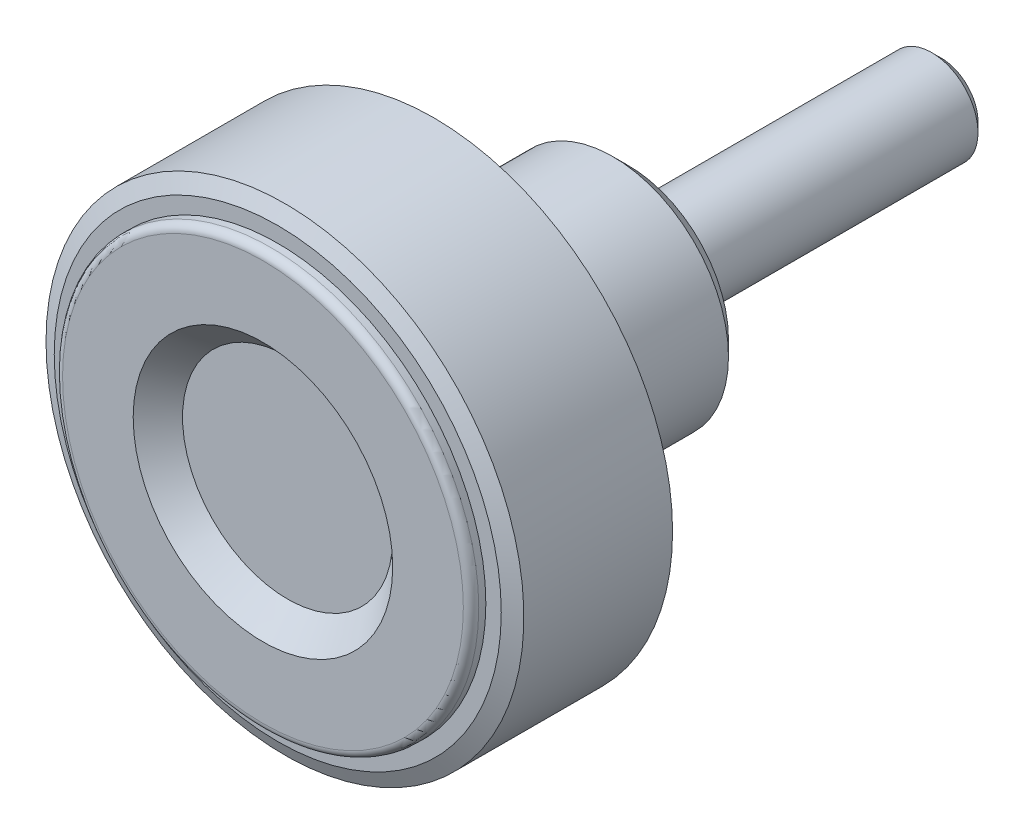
ISO-10303-21;
HEADER;
FILE_DESCRIPTION(('STEP AP214'),'2;1');
FILE_NAME('part.step','',(''),(''),'','','');
FILE_SCHEMA(('AUTOMOTIVE_DESIGN { 1 0 10303 214 1 1 1 1 }'));
ENDSEC;
DATA;
#1=APPLICATION_CONTEXT('core data for automotive mechanical design processes');
#2=APPLICATION_PROTOCOL_DEFINITION('international standard','automotive_design',2000,#1);
#3=PRODUCT_CONTEXT('',#1,'mechanical');
#4=PRODUCT('Part','Part','',(#3));
#5=PRODUCT_RELATED_PRODUCT_CATEGORY('part','',(#4));
#6=PRODUCT_DEFINITION_FORMATION('','',#4);
#7=PRODUCT_DEFINITION_CONTEXT('part definition',#1,'design');
#8=PRODUCT_DEFINITION('design','',#6,#7);
#9=PRODUCT_DEFINITION_SHAPE('','',#8);
#10=(LENGTH_UNIT() NAMED_UNIT(*) SI_UNIT(.MILLI.,.METRE.));
#11=(NAMED_UNIT(*) PLANE_ANGLE_UNIT() SI_UNIT($,.RADIAN.));
#12=(NAMED_UNIT(*) SI_UNIT($,.STERADIAN.) SOLID_ANGLE_UNIT());
#13=UNCERTAINTY_MEASURE_WITH_UNIT(LENGTH_MEASURE(1.E-05),#10,'distance_accuracy_value','');
#14=(GEOMETRIC_REPRESENTATION_CONTEXT(3) GLOBAL_UNCERTAINTY_ASSIGNED_CONTEXT((#13)) GLOBAL_UNIT_ASSIGNED_CONTEXT((#10,
#11,#12)) REPRESENTATION_CONTEXT('',''));
#15=CARTESIAN_POINT('',(0.,0.,0.));
#16=DIRECTION('',(0.,0.,1.));
#17=DIRECTION('',(1.,0.,0.));
#18=AXIS2_PLACEMENT_3D('',#15,#16,#17);
#19=CARTESIAN_POINT('',(0.,0.,0.));
#20=DIRECTION('',(0.,0.,-1.));
#21=DIRECTION('',(-1.,0.,0.));
#22=AXIS2_PLACEMENT_3D('',#19,#20,#21);
#23=CYLINDRICAL_SURFACE('',#22,15.5);
#24=CARTESIAN_POINT('',(0.,0.,22.573692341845));
#25=DIRECTION('',(0.,0.,-1.));
#26=DIRECTION('',(-1.,0.,0.));
#27=AXIS2_PLACEMENT_3D('',#24,#25,#26);
#28=CIRCLE('',#27,15.5);
#29=CARTESIAN_POINT('',(-15.5,0.,22.573692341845));
#30=VERTEX_POINT('',#29);
#31=EDGE_CURVE('E164',#30,#30,#28,.T.);
#32=ORIENTED_EDGE('',*,*,#31,.T.);
#33=EDGE_LOOP('',(#32));
#34=FACE_BOUND('',#33,.T.);
#35=CARTESIAN_POINT('',(0.,0.,12.926307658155));
#36=DIRECTION('',(0.,0.,1.));
#37=DIRECTION('',(0.,1.,0.));
#38=AXIS2_PLACEMENT_3D('',#35,#36,#37);
#39=CIRCLE('',#38,15.5);
#40=CARTESIAN_POINT('',(0.,15.5,12.926307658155));
#41=VERTEX_POINT('',#40);
#42=EDGE_CURVE('E160',#41,#41,#39,.F.);
#43=ORIENTED_EDGE('',*,*,#42,.F.);
#44=EDGE_LOOP('',(#43));
#45=FACE_BOUND('',#44,.T.);
#46=ADVANCED_FACE('F14',(#34,#45),#23,.T.);
#47=CARTESIAN_POINT('',(0.,0.,12.926307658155));
#48=DIRECTION('',(0.,0.,1.));
#49=DIRECTION('',(1.,0.,0.));
#50=AXIS2_PLACEMENT_3D('',#47,#48,#49);
#51=CONICAL_SURFACE('',#50,15.5,1.13446401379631);
#52=CARTESIAN_POINT('',(0.,0.,12.46));
#53=DIRECTION('',(0.,0.,1.));
#54=DIRECTION('',(1.,0.,0.));
#55=AXIS2_PLACEMENT_3D('',#52,#53,#54);
#56=CIRCLE('',#55,14.5);
#57=CARTESIAN_POINT('',(14.5,0.,12.46));
#58=VERTEX_POINT('',#57);
#59=EDGE_CURVE('E157',#58,#58,#56,.F.);
#60=ORIENTED_EDGE('',*,*,#59,.F.);
#61=EDGE_LOOP('',(#60));
#62=FACE_BOUND('',#61,.T.);
#63=ORIENTED_EDGE('',*,*,#42,.T.);
#64=EDGE_LOOP('',(#63));
#65=FACE_BOUND('',#64,.T.);
#66=ADVANCED_FACE('F457',(#62,#65),#51,.T.);
#67=CARTESIAN_POINT('',(0.,14.,12.46));
#68=DIRECTION('',(0.,0.,-1.));
#69=DIRECTION('',(-1.,0.,0.));
#70=AXIS2_PLACEMENT_3D('',#67,#68,#69);
#71=PLANE('',#70);
#72=ORIENTED_EDGE('',*,*,#59,.T.);
#73=EDGE_LOOP('',(#72));
#74=FACE_BOUND('',#73,.T.);
#75=CARTESIAN_POINT('',(0.,0.,12.46));
#76=DIRECTION('',(0.,0.,1.));
#77=DIRECTION('',(1.,0.,0.));
#78=AXIS2_PLACEMENT_3D('',#75,#76,#77);
#79=CIRCLE('',#78,13.5);
#80=CARTESIAN_POINT('',(13.5,0.,12.46));
#81=VERTEX_POINT('',#80);
#82=EDGE_CURVE('E154',#81,#81,#79,.F.);
#83=ORIENTED_EDGE('',*,*,#82,.F.);
#84=EDGE_LOOP('',(#83));
#85=FACE_BOUND('',#84,.T.);
#86=ADVANCED_FACE('F453',(#74,#85),#71,.T.);
#87=CARTESIAN_POINT('',(0.,1.19325,-20.));
#88=DIRECTION('',(0.,0.,-1.));
#89=DIRECTION('',(-1.,0.,0.));
#90=AXIS2_PLACEMENT_3D('',#87,#88,#89);
#91=PLANE('',#90);
#92=CARTESIAN_POINT('',(0.,0.,-19.9999999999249));
#93=DIRECTION('',(0.,0.,1.));
#94=DIRECTION('',(1.,0.,0.));
#95=AXIS2_PLACEMENT_3D('',#92,#93,#94);
#96=CIRCLE('',#95,2.38650000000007);
#97=CARTESIAN_POINT('',(2.38650000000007,0.,-19.9999999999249));
#98=VERTEX_POINT('',#97);
#99=EDGE_CURVE('E150',#98,#98,#96,.T.);
#100=ORIENTED_EDGE('',*,*,#99,.F.);
#101=EDGE_LOOP('',(#100));
#102=FACE_BOUND('',#101,.T.);
#103=ADVANCED_FACE('F449',(#102),#91,.T.);
#104=CARTESIAN_POINT('',(0.,0.,12.23));
#105=DIRECTION('',(0.,0.,1.));
#106=DIRECTION('',(1.,0.,0.));
#107=AXIS2_PLACEMENT_3D('',#104,#105,#106);
#108=CYLINDRICAL_SURFACE('',#107,13.5);
#109=ORIENTED_EDGE('',*,*,#82,.T.);
#110=EDGE_LOOP('',(#109));
#111=FACE_BOUND('',#110,.T.);
#112=CARTESIAN_POINT('',(0.,0.,12.));
#113=DIRECTION('',(0.,0.,-1.));
#114=DIRECTION('',(-1.,0.,0.));
#115=AXIS2_PLACEMENT_3D('',#112,#113,#114);
#116=CIRCLE('',#115,13.5);
#117=CARTESIAN_POINT('',(-13.5,0.,12.));
#118=VERTEX_POINT('',#117);
#119=EDGE_CURVE('E153',#118,#118,#116,.T.);
#120=ORIENTED_EDGE('',*,*,#119,.F.);
#121=EDGE_LOOP('',(#120));
#122=FACE_BOUND('',#121,.T.);
#123=ADVANCED_FACE('F416',(#111,#122),#108,.T.);
#124=CARTESIAN_POINT('',(0.,0.,-19.386499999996));
#125=DIRECTION('',(0.,0.,1.));
#126=DIRECTION('',(1.,0.,0.));
#127=AXIS2_PLACEMENT_3D('',#124,#125,#126);
#128=CONICAL_SURFACE('',#127,2.99999999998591,0.785398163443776);
#129=ORIENTED_EDGE('',*,*,#99,.T.);
#130=EDGE_LOOP('',(#129));
#131=FACE_BOUND('',#130,.T.);
#132=CARTESIAN_POINT('',(0.,0.,-19.3865));
#133=DIRECTION('',(0.,0.,1.));
#134=DIRECTION('',(1.,0.,0.));
#135=AXIS2_PLACEMENT_3D('',#132,#133,#134);
#136=CIRCLE('',#135,3.);
#137=CARTESIAN_POINT('',(3.,0.,-19.3865));
#138=VERTEX_POINT('',#137);
#139=EDGE_CURVE('E343',#138,#138,#136,.T.);
#140=ORIENTED_EDGE('',*,*,#139,.F.);
#141=EDGE_LOOP('',(#140));
#142=FACE_BOUND('',#141,.T.);
#143=ADVANCED_FACE('F410',(#131,#142),#128,.T.);
#144=CARTESIAN_POINT('',(0.,0.,12.));
#145=DIRECTION('',(0.,0.,-1.));
#146=DIRECTION('',(-1.,0.,0.));
#147=AXIS2_PLACEMENT_3D('',#144,#145,#146);
#148=TOROIDAL_SURFACE('',#147,13.,0.5);
#149=ORIENTED_EDGE('',*,*,#119,.T.);
#150=EDGE_LOOP('',(#149));
#151=FACE_BOUND('',#150,.T.);
#152=CARTESIAN_POINT('',(0.,0.,11.5));
#153=DIRECTION('',(0.,0.,1.));
#154=DIRECTION('',(1.,0.,0.));
#155=AXIS2_PLACEMENT_3D('',#152,#153,#154);
#156=CIRCLE('',#155,13.);
#157=CARTESIAN_POINT('',(0.,13.,11.5));
#158=VERTEX_POINT('',#157);
#159=CARTESIAN_POINT('',(13.,0.,11.5));
#160=VERTEX_POINT('',#159);
#161=EDGE_CURVE('E306',#158,#160,#156,.F.);
#162=ORIENTED_EDGE('',*,*,#161,.F.);
#163=CARTESIAN_POINT('',(0.,0.,11.5));
#164=DIRECTION('',(0.,0.,1.));
#165=DIRECTION('',(0.,1.,0.));
#166=AXIS2_PLACEMENT_3D('',#163,#164,#165);
#167=CIRCLE('',#166,13.);
#168=CARTESIAN_POINT('',(-13.,0.,11.5));
#169=VERTEX_POINT('',#168);
#170=EDGE_CURVE('E149',#169,#158,#167,.F.);
#171=ORIENTED_EDGE('',*,*,#170,.F.);
#172=CARTESIAN_POINT('',(0.,0.,11.5));
#173=DIRECTION('',(0.,0.,1.));
#174=DIRECTION('',(-1.,0.,0.));
#175=AXIS2_PLACEMENT_3D('',#172,#173,#174);
#176=CIRCLE('',#175,13.);
#177=EDGE_CURVE('E340',#160,#169,#176,.F.);
#178=ORIENTED_EDGE('',*,*,#177,.F.);
#179=EDGE_LOOP('',(#162,#171,#178));
#180=FACE_BOUND('',#179,.T.);
#181=ADVANCED_FACE('F405',(#151,#180),#148,.T.);
#182=CARTESIAN_POINT('',(0.,0.,-9.19325));
#183=DIRECTION('',(0.,0.,1.));
#184=DIRECTION('',(1.,0.,0.));
#185=AXIS2_PLACEMENT_3D('',#182,#183,#184);
#186=CYLINDRICAL_SURFACE('',#185,3.);
#187=ORIENTED_EDGE('',*,*,#139,.T.);
#188=EDGE_LOOP('',(#187));
#189=FACE_BOUND('',#188,.T.);
#190=CARTESIAN_POINT('',(0.,0.,0.));
#191=DIRECTION('',(0.,0.,1.));
#192=DIRECTION('',(1.,0.,0.));
#193=AXIS2_PLACEMENT_3D('',#190,#191,#192);
#194=CIRCLE('',#193,3.);
#195=CARTESIAN_POINT('',(3.,0.,0.));
#196=VERTEX_POINT('',#195);
#197=EDGE_CURVE('E146',#196,#196,#194,.T.);
#198=ORIENTED_EDGE('',*,*,#197,.F.);
#199=EDGE_LOOP('',(#198));
#200=FACE_BOUND('',#199,.T.);
#201=ADVANCED_FACE('F323',(#189,#200),#186,.T.);
#202=CARTESIAN_POINT('',(0.,12.4615384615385,11.5));
#203=DIRECTION('',(0.,0.,-1.));
#204=DIRECTION('',(-1.,0.,0.));
#205=AXIS2_PLACEMENT_3D('',#202,#203,#204);
#206=PLANE('',#205);
#207=ORIENTED_EDGE('',*,*,#177,.T.);
#208=ORIENTED_EDGE('',*,*,#170,.T.);
#209=ORIENTED_EDGE('',*,*,#161,.T.);
#210=EDGE_LOOP('',(#207,#208,#209));
#211=FACE_BOUND('',#210,.T.);
#212=CARTESIAN_POINT('',(0.,0.,11.5));
#213=DIRECTION('',(0.,0.,1.));
#214=DIRECTION('',(1.,0.,0.));
#215=AXIS2_PLACEMENT_3D('',#212,#213,#214);
#216=CIRCLE('',#215,11.9230769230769);
#217=CARTESIAN_POINT('',(11.9230769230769,0.,11.5));
#218=VERTEX_POINT('',#217);
#219=EDGE_CURVE('E143',#218,#218,#216,.T.);
#220=ORIENTED_EDGE('',*,*,#219,.T.);
#221=EDGE_LOOP('',(#220));
#222=FACE_BOUND('',#221,.T.);
#223=ADVANCED_FACE('F312',(#211,#222),#206,.T.);
#224=CARTESIAN_POINT('',(0.,2.,0.));
#225=DIRECTION('',(0.,0.,-1.));
#226=DIRECTION('',(-1.,0.,0.));
#227=AXIS2_PLACEMENT_3D('',#224,#225,#226);
#228=PLANE('',#227);
#229=CARTESIAN_POINT('',(0.,0.,0.));
#230=DIRECTION('',(0.,0.,1.));
#231=DIRECTION('',(1.,0.,0.));
#232=AXIS2_PLACEMENT_3D('',#229,#230,#231);
#233=CIRCLE('',#232,4.);
#234=CARTESIAN_POINT('',(4.,0.,0.));
#235=VERTEX_POINT('',#234);
#236=EDGE_CURVE('E140',#235,#235,#233,.T.);
#237=ORIENTED_EDGE('',*,*,#236,.F.);
#238=EDGE_LOOP('',(#237));
#239=FACE_BOUND('',#238,.T.);
#240=ORIENTED_EDGE('',*,*,#197,.T.);
#241=EDGE_LOOP('',(#240));
#242=FACE_BOUND('',#241,.T.);
#243=ADVANCED_FACE('F322',(#239,#242),#228,.T.);
#244=CARTESIAN_POINT('',(0.,0.,15.25));
#245=DIRECTION('',(0.,0.,1.));
#246=DIRECTION('',(1.,0.,0.));
#247=AXIS2_PLACEMENT_3D('',#244,#245,#246);
#248=CYLINDRICAL_SURFACE('',#247,11.9230769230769);
#249=CARTESIAN_POINT('',(0.,0.,19.));
#250=DIRECTION('',(0.,0.,-1.));
#251=DIRECTION('',(-1.,0.,0.));
#252=AXIS2_PLACEMENT_3D('',#249,#250,#251);
#253=CIRCLE('',#252,11.9230769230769);
#254=CARTESIAN_POINT('',(-11.9230769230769,0.,19.));
#255=VERTEX_POINT('',#254);
#256=EDGE_CURVE('E139',#255,#255,#253,.F.);
#257=ORIENTED_EDGE('',*,*,#256,.T.);
#258=EDGE_LOOP('',(#257));
#259=FACE_BOUND('',#258,.T.);
#260=ORIENTED_EDGE('',*,*,#219,.F.);
#261=EDGE_LOOP('',(#260));
#262=FACE_BOUND('',#261,.T.);
#263=ADVANCED_FACE('F391',(#259,#262),#248,.F.);
#264=CARTESIAN_POINT('',(0.,0.,0.15));
#265=DIRECTION('',(0.,0.,1.));
#266=DIRECTION('',(1.,0.,0.));
#267=AXIS2_PLACEMENT_3D('',#264,#265,#266);
#268=CYLINDRICAL_SURFACE('',#267,4.);
#269=ORIENTED_EDGE('',*,*,#236,.T.);
#270=EDGE_LOOP('',(#269));
#271=FACE_BOUND('',#270,.T.);
#272=CARTESIAN_POINT('',(0.,0.,0.3));
#273=DIRECTION('',(0.,0.,1.));
#274=DIRECTION('',(1.,0.,0.));
#275=AXIS2_PLACEMENT_3D('',#272,#273,#274);
#276=CIRCLE('',#275,4.);
#277=CARTESIAN_POINT('',(4.,0.,0.3));
#278=VERTEX_POINT('',#277);
#279=EDGE_CURVE('E135',#278,#278,#276,.T.);
#280=ORIENTED_EDGE('',*,*,#279,.F.);
#281=EDGE_LOOP('',(#280));
#282=FACE_BOUND('',#281,.T.);
#283=ADVANCED_FACE('F282',(#271,#282),#268,.T.);
#284=CARTESIAN_POINT('',(0.,0.,19.));
#285=DIRECTION('',(0.,0.,-1.));
#286=DIRECTION('',(-1.,0.,0.));
#287=AXIS2_PLACEMENT_3D('',#284,#285,#286);
#288=TOROIDAL_SURFACE('',#287,10.9230769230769,1.);
#289=CARTESIAN_POINT('',(0.,0.,20.));
#290=DIRECTION('',(0.,0.,1.));
#291=DIRECTION('',(0.,1.,0.));
#292=AXIS2_PLACEMENT_3D('',#289,#290,#291);
#293=CIRCLE('',#292,10.9230769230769);
#294=CARTESIAN_POINT('',(-10.9230769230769,0.,20.));
#295=VERTEX_POINT('',#294);
#296=CARTESIAN_POINT('',(0.,10.9230769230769,20.));
#297=VERTEX_POINT('',#296);
#298=EDGE_CURVE('E134',#295,#297,#293,.F.);
#299=ORIENTED_EDGE('',*,*,#298,.F.);
#300=CARTESIAN_POINT('',(0.,0.,20.));
#301=DIRECTION('',(0.,0.,1.));
#302=DIRECTION('',(-1.,0.,0.));
#303=AXIS2_PLACEMENT_3D('',#300,#301,#302);
#304=CIRCLE('',#303,10.9230769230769);
#305=CARTESIAN_POINT('',(10.9230769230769,0.,20.));
#306=VERTEX_POINT('',#305);
#307=EDGE_CURVE('E656',#306,#295,#304,.F.);
#308=ORIENTED_EDGE('',*,*,#307,.F.);
#309=CARTESIAN_POINT('',(0.,0.,20.));
#310=DIRECTION('',(0.,0.,1.));
#311=DIRECTION('',(1.,0.,0.));
#312=AXIS2_PLACEMENT_3D('',#309,#310,#311);
#313=CIRCLE('',#312,10.9230769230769);
#314=EDGE_CURVE('E138',#297,#306,#313,.F.);
#315=ORIENTED_EDGE('',*,*,#314,.F.);
#316=EDGE_LOOP('',(#299,#308,#315));
#317=FACE_BOUND('',#316,.T.);
#318=ORIENTED_EDGE('',*,*,#256,.F.);
#319=EDGE_LOOP('',(#318));
#320=FACE_BOUND('',#319,.T.);
#321=ADVANCED_FACE('F278',(#317,#320),#288,.F.);
#322=CARTESIAN_POINT('',(0.,5.25,0.3));
#323=DIRECTION('',(0.,0.,-1.));
#324=DIRECTION('',(-1.,0.,0.));
#325=AXIS2_PLACEMENT_3D('',#322,#323,#324);
#326=PLANE('',#325);
#327=CARTESIAN_POINT('',(0.,0.,0.3));
#328=DIRECTION('',(0.,0.,1.));
#329=DIRECTION('',(1.,0.,0.));
#330=AXIS2_PLACEMENT_3D('',#327,#328,#329);
#331=CIRCLE('',#330,6.5);
#332=CARTESIAN_POINT('',(6.5,0.,0.3));
#333=VERTEX_POINT('',#332);
#334=EDGE_CURVE('E125',#333,#333,#331,.T.);
#335=ORIENTED_EDGE('',*,*,#334,.F.);
#336=EDGE_LOOP('',(#335));
#337=FACE_BOUND('',#336,.T.);
#338=ORIENTED_EDGE('',*,*,#279,.T.);
#339=EDGE_LOOP('',(#338));
#340=FACE_BOUND('',#339,.T.);
#341=ADVANCED_FACE('F216',(#337,#340),#326,.T.);
#342=CARTESIAN_POINT('',(0.,9.71153846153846,20.));
#343=DIRECTION('',(0.,0.,-1.));
#344=DIRECTION('',(-1.,0.,0.));
#345=AXIS2_PLACEMENT_3D('',#342,#343,#344);
#346=PLANE('',#345);
#347=ORIENTED_EDGE('',*,*,#307,.T.);
#348=ORIENTED_EDGE('',*,*,#298,.T.);
#349=ORIENTED_EDGE('',*,*,#314,.T.);
#350=EDGE_LOOP('',(#347,#348,#349));
#351=FACE_BOUND('',#350,.T.);
#352=CARTESIAN_POINT('',(0.,0.,20.));
#353=DIRECTION('',(0.,0.,-1.));
#354=DIRECTION('',(-1.,0.,0.));
#355=AXIS2_PLACEMENT_3D('',#352,#353,#354);
#356=CIRCLE('',#355,8.5);
#357=CARTESIAN_POINT('',(0.,8.5,20.));
#358=VERTEX_POINT('',#357);
#359=CARTESIAN_POINT('',(-8.5,0.,20.));
#360=VERTEX_POINT('',#359);
#361=EDGE_CURVE('E33',#358,#360,#356,.F.);
#362=ORIENTED_EDGE('',*,*,#361,.T.);
#363=CARTESIAN_POINT('',(0.,0.,20.));
#364=DIRECTION('',(0.,0.,-1.));
#365=DIRECTION('',(1.,0.,0.));
#366=AXIS2_PLACEMENT_3D('',#363,#364,#365);
#367=CIRCLE('',#366,8.5);
#368=CARTESIAN_POINT('',(8.5,0.,20.));
#369=VERTEX_POINT('',#368);
#370=EDGE_CURVE('E133',#360,#369,#367,.F.);
#371=ORIENTED_EDGE('',*,*,#370,.T.);
#372=CARTESIAN_POINT('',(0.,0.,20.));
#373=DIRECTION('',(0.,0.,-1.));
#374=DIRECTION('',(0.,1.,0.));
#375=AXIS2_PLACEMENT_3D('',#372,#373,#374);
#376=CIRCLE('',#375,8.5);
#377=EDGE_CURVE('E203',#369,#358,#376,.F.);
#378=ORIENTED_EDGE('',*,*,#377,.T.);
#379=EDGE_LOOP('',(#362,#371,#378));
#380=FACE_BOUND('',#379,.T.);
#381=ADVANCED_FACE('F207',(#351,#380),#346,.T.);
#382=CARTESIAN_POINT('',(0.,0.,1.3));
#383=DIRECTION('',(0.,0.,1.));
#384=DIRECTION('',(1.,0.,0.));
#385=AXIS2_PLACEMENT_3D('',#382,#383,#384);
#386=CONICAL_SURFACE('',#385,7.5,0.785398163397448);
#387=ORIENTED_EDGE('',*,*,#334,.T.);
#388=EDGE_LOOP('',(#387));
#389=FACE_BOUND('',#388,.T.);
#390=CARTESIAN_POINT('',(0.,0.,1.3));
#391=DIRECTION('',(0.,0.,1.));
#392=DIRECTION('',(1.,0.,0.));
#393=AXIS2_PLACEMENT_3D('',#390,#391,#392);
#394=CIRCLE('',#393,7.5);
#395=CARTESIAN_POINT('',(7.5,0.,1.3));
#396=VERTEX_POINT('',#395);
#397=EDGE_CURVE('E24',#396,#396,#394,.T.);
#398=ORIENTED_EDGE('',*,*,#397,.F.);
#399=EDGE_LOOP('',(#398));
#400=FACE_BOUND('',#399,.T.);
#401=ADVANCED_FACE('F194',(#389,#400),#386,.T.);
#402=CARTESIAN_POINT('',(0.,0.,19.));
#403=DIRECTION('',(0.,0.,-1.));
#404=DIRECTION('',(-1.,0.,0.));
#405=AXIS2_PLACEMENT_3D('',#402,#403,#404);
#406=TOROIDAL_SURFACE('',#405,8.5,1.);
#407=CARTESIAN_POINT('',(0.,0.,19.));
#408=DIRECTION('',(0.,0.,1.));
#409=DIRECTION('',(1.,0.,0.));
#410=AXIS2_PLACEMENT_3D('',#407,#408,#409);
#411=CIRCLE('',#410,7.5);
#412=CARTESIAN_POINT('',(7.5,0.,19.));
#413=VERTEX_POINT('',#412);
#414=EDGE_CURVE('E9',#413,#413,#411,.F.);
#415=ORIENTED_EDGE('',*,*,#414,.F.);
#416=EDGE_LOOP('',(#415));
#417=FACE_BOUND('',#416,.T.);
#418=ORIENTED_EDGE('',*,*,#370,.F.);
#419=ORIENTED_EDGE('',*,*,#361,.F.);
#420=ORIENTED_EDGE('',*,*,#377,.F.);
#421=EDGE_LOOP('',(#418,#419,#420));
#422=FACE_BOUND('',#421,.T.);
#423=ADVANCED_FACE('F182',(#417,#422),#406,.F.);
#424=CARTESIAN_POINT('',(0.,0.,10.15));
#425=DIRECTION('',(0.,0.,1.));
#426=DIRECTION('',(1.,0.,0.));
#427=AXIS2_PLACEMENT_3D('',#424,#425,#426);
#428=CYLINDRICAL_SURFACE('',#427,7.5);
#429=ORIENTED_EDGE('',*,*,#397,.T.);
#430=EDGE_LOOP('',(#429));
#431=FACE_BOUND('',#430,.T.);
#432=ORIENTED_EDGE('',*,*,#414,.T.);
#433=EDGE_LOOP('',(#432));
#434=FACE_BOUND('',#433,.T.);
#435=ADVANCED_FACE('F193',(#431,#434),#428,.T.);
#436=CARTESIAN_POINT('',(0.,3.40909090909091,22.4));
#437=DIRECTION('',(0.,0.,1.));
#438=DIRECTION('',(1.,0.,0.));
#439=AXIS2_PLACEMENT_3D('',#436,#437,#438);
#440=PLANE('',#439);
#441=CARTESIAN_POINT('',(0.,0.,22.4));
#442=DIRECTION('',(0.,0.,1.));
#443=DIRECTION('',(1.,0.,0.));
#444=AXIS2_PLACEMENT_3D('',#441,#442,#443);
#445=CIRCLE('',#444,6.81818181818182);
#446=CARTESIAN_POINT('',(6.81818181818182,0.,22.4));
#447=VERTEX_POINT('',#446);
#448=EDGE_CURVE('E171',#447,#447,#445,.T.);
#449=ORIENTED_EDGE('',*,*,#448,.T.);
#450=EDGE_LOOP('',(#449));
#451=FACE_BOUND('',#450,.T.);
#452=ADVANCED_FACE('F16',(#451),#440,.T.);
#453=CARTESIAN_POINT('',(0.,0.,24.));
#454=DIRECTION('',(0.,0.,1.));
#455=DIRECTION('',(1.,0.,0.));
#456=AXIS2_PLACEMENT_3D('',#453,#454,#455);
#457=CONICAL_SURFACE('',#456,8.41818181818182,0.785398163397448);
#458=CARTESIAN_POINT('',(0.,0.,24.));
#459=DIRECTION('',(0.,0.,1.));
#460=DIRECTION('',(1.,0.,0.));
#461=AXIS2_PLACEMENT_3D('',#458,#459,#460);
#462=CIRCLE('',#461,8.41818181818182);
#463=CARTESIAN_POINT('',(8.41818181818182,0.,24.));
#464=VERTEX_POINT('',#463);
#465=EDGE_CURVE('E77',#464,#464,#462,.F.);
#466=ORIENTED_EDGE('',*,*,#465,.F.);
#467=EDGE_LOOP('',(#466));
#468=FACE_BOUND('',#467,.T.);
#469=ORIENTED_EDGE('',*,*,#448,.F.);
#470=EDGE_LOOP('',(#469));
#471=FACE_BOUND('',#470,.T.);
#472=ADVANCED_FACE('F99',(#468,#471),#457,.F.);
#473=CARTESIAN_POINT('',(0.,10.7090909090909,24.));
#474=DIRECTION('',(0.,0.,1.));
#475=DIRECTION('',(1.,0.,0.));
#476=AXIS2_PLACEMENT_3D('',#473,#474,#475);
#477=PLANE('',#476);
#478=ORIENTED_EDGE('',*,*,#465,.T.);
#479=EDGE_LOOP('',(#478));
#480=FACE_BOUND('',#479,.T.);
#481=CARTESIAN_POINT('',(0.,0.,24.));
#482=DIRECTION('',(0.,0.,-1.));
#483=DIRECTION('',(-1.,0.,0.));
#484=AXIS2_PLACEMENT_3D('',#481,#482,#483);
#485=CIRCLE('',#484,13.);
#486=CARTESIAN_POINT('',(-13.,0.,24.));
#487=VERTEX_POINT('',#486);
#488=CARTESIAN_POINT('',(0.,13.,24.));
#489=VERTEX_POINT('',#488);
#490=EDGE_CURVE('E71',#487,#489,#485,.T.);
#491=ORIENTED_EDGE('',*,*,#490,.F.);
#492=CARTESIAN_POINT('',(0.,0.,24.));
#493=DIRECTION('',(0.,0.,-1.));
#494=DIRECTION('',(1.,0.,0.));
#495=AXIS2_PLACEMENT_3D('',#492,#493,#494);
#496=CIRCLE('',#495,13.);
#497=CARTESIAN_POINT('',(13.,0.,24.));
#498=VERTEX_POINT('',#497);
#499=EDGE_CURVE('E66',#498,#487,#496,.T.);
#500=ORIENTED_EDGE('',*,*,#499,.F.);
#501=CARTESIAN_POINT('',(0.,0.,24.));
#502=DIRECTION('',(0.,0.,-1.));
#503=DIRECTION('',(0.,1.,0.));
#504=AXIS2_PLACEMENT_3D('',#501,#502,#503);
#505=CIRCLE('',#504,13.);
#506=EDGE_CURVE('E73',#489,#498,#505,.T.);
#507=ORIENTED_EDGE('',*,*,#506,.F.);
#508=EDGE_LOOP('',(#491,#500,#507));
#509=FACE_BOUND('',#508,.T.);
#510=ADVANCED_FACE('F81',(#480,#509),#477,.T.);
#511=CARTESIAN_POINT('',(0.,0.,23.5));
#512=DIRECTION('',(0.,0.,-1.));
#513=DIRECTION('',(-1.,0.,0.));
#514=AXIS2_PLACEMENT_3D('',#511,#512,#513);
#515=TOROIDAL_SURFACE('',#514,13.,0.5);
#516=ORIENTED_EDGE('',*,*,#499,.T.);
#517=ORIENTED_EDGE('',*,*,#490,.T.);
#518=ORIENTED_EDGE('',*,*,#506,.T.);
#519=EDGE_LOOP('',(#516,#517,#518));
#520=FACE_BOUND('',#519,.T.);
#521=CARTESIAN_POINT('',(0.,0.,23.5));
#522=DIRECTION('',(0.,0.,1.));
#523=DIRECTION('',(1.,0.,0.));
#524=AXIS2_PLACEMENT_3D('',#521,#522,#523);
#525=CIRCLE('',#524,13.5);
#526=CARTESIAN_POINT('',(13.5,0.,23.5));
#527=VERTEX_POINT('',#526);
#528=EDGE_CURVE('E168',#527,#527,#525,.F.);
#529=ORIENTED_EDGE('',*,*,#528,.F.);
#530=EDGE_LOOP('',(#529));
#531=FACE_BOUND('',#530,.T.);
#532=ADVANCED_FACE('F69',(#520,#531),#515,.T.);
#533=CARTESIAN_POINT('',(0.,0.,23.27));
#534=DIRECTION('',(0.,0.,1.));
#535=DIRECTION('',(1.,0.,0.));
#536=AXIS2_PLACEMENT_3D('',#533,#534,#535);
#537=CYLINDRICAL_SURFACE('',#536,13.5);
#538=CARTESIAN_POINT('',(0.,0.,23.04));
#539=DIRECTION('',(0.,0.,1.));
#540=DIRECTION('',(1.,0.,0.));
#541=AXIS2_PLACEMENT_3D('',#538,#539,#540);
#542=CIRCLE('',#541,13.5);
#543=CARTESIAN_POINT('',(13.5,0.,23.04));
#544=VERTEX_POINT('',#543);
#545=EDGE_CURVE('E165',#544,#544,#542,.F.);
#546=ORIENTED_EDGE('',*,*,#545,.F.);
#547=EDGE_LOOP('',(#546));
#548=FACE_BOUND('',#547,.T.);
#549=ORIENTED_EDGE('',*,*,#528,.T.);
#550=EDGE_LOOP('',(#549));
#551=FACE_BOUND('',#550,.T.);
#552=ADVANCED_FACE('F359',(#548,#551),#537,.T.);
#553=CARTESIAN_POINT('',(0.,0.,22.573692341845));
#554=DIRECTION('',(0.,0.,-1.));
#555=DIRECTION('',(-1.,0.,0.));
#556=AXIS2_PLACEMENT_3D('',#553,#554,#555);
#557=CONICAL_SURFACE('',#556,15.5,1.13446401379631);
#558=ORIENTED_EDGE('',*,*,#31,.F.);
#559=EDGE_LOOP('',(#558));
#560=FACE_BOUND('',#559,.T.);
#561=CARTESIAN_POINT('',(0.,0.,23.04));
#562=DIRECTION('',(0.,0.,-1.));
#563=DIRECTION('',(-1.,0.,0.));
#564=AXIS2_PLACEMENT_3D('',#561,#562,#563);
#565=CIRCLE('',#564,14.5);
#566=CARTESIAN_POINT('',(-14.5,0.,23.04));
#567=VERTEX_POINT('',#566);
#568=EDGE_CURVE('E161',#567,#567,#565,.T.);
#569=ORIENTED_EDGE('',*,*,#568,.T.);
#570=EDGE_LOOP('',(#569));
#571=FACE_BOUND('',#570,.T.);
#572=ADVANCED_FACE('F366',(#560,#571),#557,.T.);
#573=CARTESIAN_POINT('',(0.,14.,23.04));
#574=DIRECTION('',(0.,0.,1.));
#575=DIRECTION('',(1.,0.,0.));
#576=AXIS2_PLACEMENT_3D('',#573,#574,#575);
#577=PLANE('',#576);
#578=ORIENTED_EDGE('',*,*,#545,.T.);
#579=EDGE_LOOP('',(#578));
#580=FACE_BOUND('',#579,.T.);
#581=ORIENTED_EDGE('',*,*,#568,.F.);
#582=EDGE_LOOP('',(#581));
#583=FACE_BOUND('',#582,.T.);
#584=ADVANCED_FACE('F467',(#580,#583),#577,.T.);
#585=CLOSED_SHELL('',(#46,#66,#86,#103,#123,#143,#181,#201,#223,#243,#263,#283,#321,#341,#381,
#401,#423,#435,#452,#472,#510,#532,#552,#572,#584));
#586=MANIFOLD_SOLID_BREP('B1',#585);
#587=ADVANCED_BREP_SHAPE_REPRESENTATION('',(#18,#586),#14);
#588=SHAPE_DEFINITION_REPRESENTATION(#9,#587);
ENDSEC;
END-ISO-10303-21;
